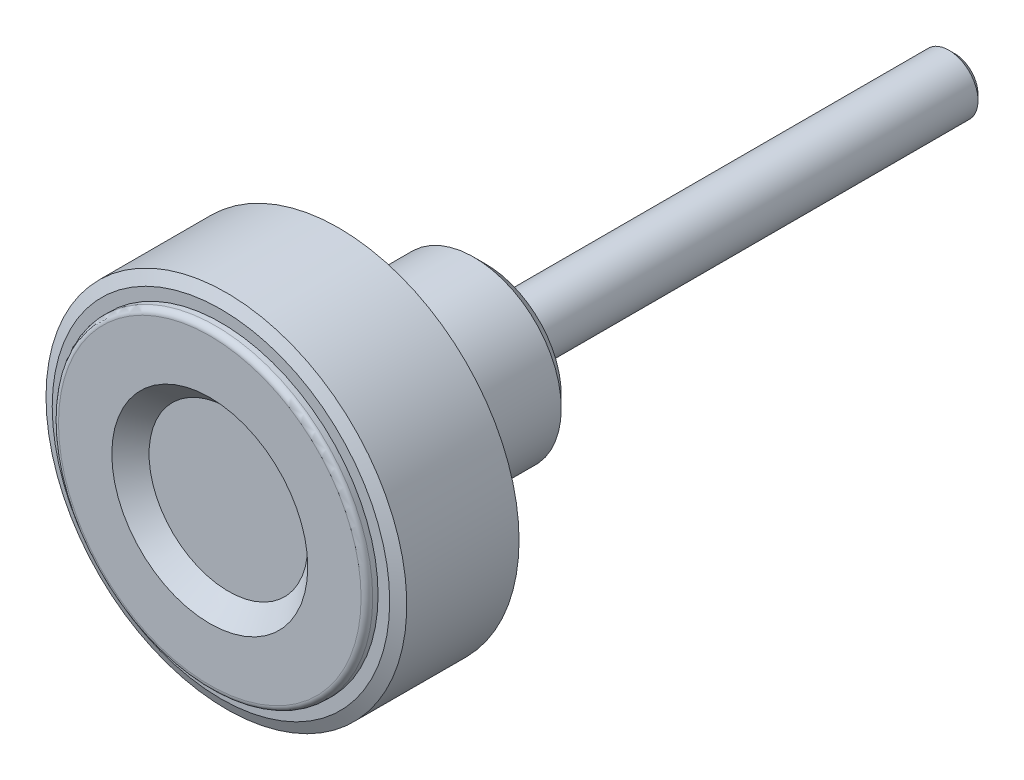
ISO-10303-21;
HEADER;
FILE_DESCRIPTION(('STEP AP214'),'2;1');
FILE_NAME('part.step','',(''),(''),'','','');
FILE_SCHEMA(('AUTOMOTIVE_DESIGN { 1 0 10303 214 1 1 1 1 }'));
ENDSEC;
DATA;
#1=APPLICATION_CONTEXT('core data for automotive mechanical design processes');
#2=APPLICATION_PROTOCOL_DEFINITION('international standard','automotive_design',2000,#1);
#3=PRODUCT_CONTEXT('',#1,'mechanical');
#4=PRODUCT('Part','Part','',(#3));
#5=PRODUCT_RELATED_PRODUCT_CATEGORY('part','',(#4));
#6=PRODUCT_DEFINITION_FORMATION('','',#4);
#7=PRODUCT_DEFINITION_CONTEXT('part definition',#1,'design');
#8=PRODUCT_DEFINITION('design','',#6,#7);
#9=PRODUCT_DEFINITION_SHAPE('','',#8);
#10=(LENGTH_UNIT() NAMED_UNIT(*) SI_UNIT(.MILLI.,.METRE.));
#11=(NAMED_UNIT(*) PLANE_ANGLE_UNIT() SI_UNIT($,.RADIAN.));
#12=(NAMED_UNIT(*) SI_UNIT($,.STERADIAN.) SOLID_ANGLE_UNIT());
#13=UNCERTAINTY_MEASURE_WITH_UNIT(LENGTH_MEASURE(1.E-05),#10,'distance_accuracy_value','');
#14=(GEOMETRIC_REPRESENTATION_CONTEXT(3) GLOBAL_UNCERTAINTY_ASSIGNED_CONTEXT((#13)) GLOBAL_UNIT_ASSIGNED_CONTEXT((#10,
#11,#12)) REPRESENTATION_CONTEXT('',''));
#15=CARTESIAN_POINT('',(0.,0.,0.));
#16=DIRECTION('',(0.,0.,1.));
#17=DIRECTION('',(1.,0.,0.));
#18=AXIS2_PLACEMENT_3D('',#15,#16,#17);
#19=CARTESIAN_POINT('',(0.,0.,0.));
#20=DIRECTION('',(0.,0.,-1.));
#21=DIRECTION('',(-1.,0.,0.));
#22=AXIS2_PLACEMENT_3D('',#19,#20,#21);
#23=CYLINDRICAL_SURFACE('',#22,15.5);
#24=CARTESIAN_POINT('',(0.,0.,22.573692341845));
#25=DIRECTION('',(0.,0.,-1.));
#26=DIRECTION('',(-1.,0.,0.));
#27=AXIS2_PLACEMENT_3D('',#24,#25,#26);
#28=CIRCLE('',#27,15.5);
#29=CARTESIAN_POINT('',(-15.5,0.,22.573692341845));
#30=VERTEX_POINT('',#29);
#31=EDGE_CURVE('E160',#30,#30,#28,.T.);
#32=ORIENTED_EDGE('',*,*,#31,.T.);
#33=EDGE_LOOP('',(#32));
#34=FACE_BOUND('',#33,.T.);
#35=CARTESIAN_POINT('',(0.,0.,12.926307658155));
#36=DIRECTION('',(0.,0.,1.));
#37=DIRECTION('',(0.,1.,0.));
#38=AXIS2_PLACEMENT_3D('',#35,#36,#37);
#39=CIRCLE('',#38,15.5);
#40=CARTESIAN_POINT('',(0.,15.5,12.926307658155));
#41=VERTEX_POINT('',#40);
#42=EDGE_CURVE('E156',#41,#41,#39,.F.);
#43=ORIENTED_EDGE('',*,*,#42,.F.);
#44=EDGE_LOOP('',(#43));
#45=FACE_BOUND('',#44,.T.);
#46=ADVANCED_FACE('F14',(#34,#45),#23,.T.);
#47=CARTESIAN_POINT('',(0.,0.,12.926307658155));
#48=DIRECTION('',(0.,0.,1.));
#49=DIRECTION('',(1.,0.,0.));
#50=AXIS2_PLACEMENT_3D('',#47,#48,#49);
#51=CONICAL_SURFACE('',#50,15.5,1.13446401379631);
#52=CARTESIAN_POINT('',(0.,0.,12.46));
#53=DIRECTION('',(0.,0.,1.));
#54=DIRECTION('',(1.,0.,0.));
#55=AXIS2_PLACEMENT_3D('',#52,#53,#54);
#56=CIRCLE('',#55,14.5);
#57=CARTESIAN_POINT('',(14.5,0.,12.46));
#58=VERTEX_POINT('',#57);
#59=EDGE_CURVE('E153',#58,#58,#56,.F.);
#60=ORIENTED_EDGE('',*,*,#59,.F.);
#61=EDGE_LOOP('',(#60));
#62=FACE_BOUND('',#61,.T.);
#63=ORIENTED_EDGE('',*,*,#42,.T.);
#64=EDGE_LOOP('',(#63));
#65=FACE_BOUND('',#64,.T.);
#66=ADVANCED_FACE('F397',(#62,#65),#51,.T.);
#67=CARTESIAN_POINT('',(0.,14.,12.46));
#68=DIRECTION('',(0.,0.,-1.));
#69=DIRECTION('',(-1.,0.,0.));
#70=AXIS2_PLACEMENT_3D('',#67,#68,#69);
#71=PLANE('',#70);
#72=ORIENTED_EDGE('',*,*,#59,.T.);
#73=EDGE_LOOP('',(#72));
#74=FACE_BOUND('',#73,.T.);
#75=CARTESIAN_POINT('',(0.,0.,12.46));
#76=DIRECTION('',(0.,0.,1.));
#77=DIRECTION('',(1.,0.,0.));
#78=AXIS2_PLACEMENT_3D('',#75,#76,#77);
#79=CIRCLE('',#78,13.5);
#80=CARTESIAN_POINT('',(13.5,0.,12.46));
#81=VERTEX_POINT('',#80);
#82=EDGE_CURVE('E149',#81,#81,#79,.F.);
#83=ORIENTED_EDGE('',*,*,#82,.F.);
#84=EDGE_LOOP('',(#83));
#85=FACE_BOUND('',#84,.T.);
#86=ADVANCED_FACE('F406',(#74,#85),#71,.T.);
#87=CARTESIAN_POINT('',(0.,0.,12.23));
#88=DIRECTION('',(0.,0.,1.));
#89=DIRECTION('',(1.,0.,0.));
#90=AXIS2_PLACEMENT_3D('',#87,#88,#89);
#91=CYLINDRICAL_SURFACE('',#90,13.5);
#92=ORIENTED_EDGE('',*,*,#82,.T.);
#93=EDGE_LOOP('',(#92));
#94=FACE_BOUND('',#93,.T.);
#95=CARTESIAN_POINT('',(0.,0.,12.));
#96=DIRECTION('',(0.,0.,-1.));
#97=DIRECTION('',(-1.,0.,0.));
#98=AXIS2_PLACEMENT_3D('',#95,#96,#97);
#99=CIRCLE('',#98,13.5);
#100=CARTESIAN_POINT('',(-13.5,0.,12.));
#101=VERTEX_POINT('',#100);
#102=EDGE_CURVE('E152',#101,#101,#99,.T.);
#103=ORIENTED_EDGE('',*,*,#102,.F.);
#104=EDGE_LOOP('',(#103));
#105=FACE_BOUND('',#104,.T.);
#106=ADVANCED_FACE('F581',(#94,#105),#91,.T.);
#107=CARTESIAN_POINT('',(0.,0.,12.));
#108=DIRECTION('',(0.,0.,-1.));
#109=DIRECTION('',(-1.,0.,0.));
#110=AXIS2_PLACEMENT_3D('',#107,#108,#109);
#111=TOROIDAL_SURFACE('',#110,13.,0.5);
#112=ORIENTED_EDGE('',*,*,#102,.T.);
#113=EDGE_LOOP('',(#112));
#114=FACE_BOUND('',#113,.T.);
#115=CARTESIAN_POINT('',(0.,0.,11.5));
#116=DIRECTION('',(0.,0.,1.));
#117=DIRECTION('',(1.,0.,0.));
#118=AXIS2_PLACEMENT_3D('',#115,#116,#117);
#119=CIRCLE('',#118,13.);
#120=CARTESIAN_POINT('',(0.,13.,11.5));
#121=VERTEX_POINT('',#120);
#122=CARTESIAN_POINT('',(13.,0.,11.5));
#123=VERTEX_POINT('',#122);
#124=EDGE_CURVE('E306',#121,#123,#119,.F.);
#125=ORIENTED_EDGE('',*,*,#124,.F.);
#126=CARTESIAN_POINT('',(0.,0.,11.5));
#127=DIRECTION('',(0.,0.,1.));
#128=DIRECTION('',(0.,1.,0.));
#129=AXIS2_PLACEMENT_3D('',#126,#127,#128);
#130=CIRCLE('',#129,13.);
#131=CARTESIAN_POINT('',(-13.,0.,11.5));
#132=VERTEX_POINT('',#131);
#133=EDGE_CURVE('E148',#132,#121,#130,.F.);
#134=ORIENTED_EDGE('',*,*,#133,.F.);
#135=CARTESIAN_POINT('',(0.,0.,11.5));
#136=DIRECTION('',(0.,0.,1.));
#137=DIRECTION('',(-1.,0.,0.));
#138=AXIS2_PLACEMENT_3D('',#135,#136,#137);
#139=CIRCLE('',#138,13.);
#140=EDGE_CURVE('E340',#123,#132,#139,.F.);
#141=ORIENTED_EDGE('',*,*,#140,.F.);
#142=EDGE_LOOP('',(#125,#134,#141));
#143=FACE_BOUND('',#142,.T.);
#144=ADVANCED_FACE('F439',(#114,#143),#111,.T.);
#145=CARTESIAN_POINT('',(0.,0.,-9.25475));
#146=DIRECTION('',(0.,0.,1.));
#147=DIRECTION('',(1.,0.,0.));
#148=AXIS2_PLACEMENT_3D('',#145,#146,#147);
#149=CYLINDRICAL_SURFACE('',#148,2.5);
#150=CARTESIAN_POINT('',(0.,0.,-39.51));
#151=DIRECTION('',(0.,0.,-1.));
#152=DIRECTION('',(-1.,0.,0.));
#153=AXIS2_PLACEMENT_3D('',#150,#151,#152);
#154=CIRCLE('',#153,2.5);
#155=CARTESIAN_POINT('',(-2.5,0.,-39.51));
#156=VERTEX_POINT('',#155);
#157=EDGE_CURVE('E9',#156,#156,#154,.F.);
#158=ORIENTED_EDGE('',*,*,#157,.T.);
#159=EDGE_LOOP('',(#158));
#160=FACE_BOUND('',#159,.T.);
#161=CARTESIAN_POINT('',(0.,0.,0.));
#162=DIRECTION('',(0.,0.,1.));
#163=DIRECTION('',(1.,0.,0.));
#164=AXIS2_PLACEMENT_3D('',#161,#162,#163);
#165=CIRCLE('',#164,2.5);
#166=CARTESIAN_POINT('',(2.5,0.,0.));
#167=VERTEX_POINT('',#166);
#168=EDGE_CURVE('E145',#167,#167,#165,.T.);
#169=ORIENTED_EDGE('',*,*,#168,.F.);
#170=EDGE_LOOP('',(#169));
#171=FACE_BOUND('',#170,.T.);
#172=ADVANCED_FACE('F323',(#160,#171),#149,.T.);
#173=CARTESIAN_POINT('',(0.,12.4615384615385,11.5));
#174=DIRECTION('',(0.,0.,-1.));
#175=DIRECTION('',(-1.,0.,0.));
#176=AXIS2_PLACEMENT_3D('',#173,#174,#175);
#177=PLANE('',#176);
#178=ORIENTED_EDGE('',*,*,#140,.T.);
#179=ORIENTED_EDGE('',*,*,#133,.T.);
#180=ORIENTED_EDGE('',*,*,#124,.T.);
#181=EDGE_LOOP('',(#178,#179,#180));
#182=FACE_BOUND('',#181,.T.);
#183=CARTESIAN_POINT('',(0.,0.,11.5));
#184=DIRECTION('',(0.,0.,1.));
#185=DIRECTION('',(1.,0.,0.));
#186=AXIS2_PLACEMENT_3D('',#183,#184,#185);
#187=CIRCLE('',#186,11.9230769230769);
#188=CARTESIAN_POINT('',(11.9230769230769,0.,11.5));
#189=VERTEX_POINT('',#188);
#190=EDGE_CURVE('E142',#189,#189,#187,.T.);
#191=ORIENTED_EDGE('',*,*,#190,.T.);
#192=EDGE_LOOP('',(#191));
#193=FACE_BOUND('',#192,.T.);
#194=ADVANCED_FACE('F312',(#182,#193),#177,.T.);
#195=CARTESIAN_POINT('',(0.,1.66666666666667,0.));
#196=DIRECTION('',(0.,0.,-1.));
#197=DIRECTION('',(-1.,0.,0.));
#198=AXIS2_PLACEMENT_3D('',#195,#196,#197);
#199=PLANE('',#198);
#200=CARTESIAN_POINT('',(0.,0.,0.));
#201=DIRECTION('',(0.,0.,1.));
#202=DIRECTION('',(1.,0.,0.));
#203=AXIS2_PLACEMENT_3D('',#200,#201,#202);
#204=CIRCLE('',#203,3.33333333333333);
#205=CARTESIAN_POINT('',(3.33333333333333,0.,0.));
#206=VERTEX_POINT('',#205);
#207=EDGE_CURVE('E139',#206,#206,#204,.T.);
#208=ORIENTED_EDGE('',*,*,#207,.F.);
#209=EDGE_LOOP('',(#208));
#210=FACE_BOUND('',#209,.T.);
#211=ORIENTED_EDGE('',*,*,#168,.T.);
#212=EDGE_LOOP('',(#211));
#213=FACE_BOUND('',#212,.T.);
#214=ADVANCED_FACE('F322',(#210,#213),#199,.T.);
#215=CARTESIAN_POINT('',(0.,0.,15.25));
#216=DIRECTION('',(0.,0.,1.));
#217=DIRECTION('',(1.,0.,0.));
#218=AXIS2_PLACEMENT_3D('',#215,#216,#217);
#219=CYLINDRICAL_SURFACE('',#218,11.9230769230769);
#220=CARTESIAN_POINT('',(0.,0.,19.));
#221=DIRECTION('',(0.,0.,-1.));
#222=DIRECTION('',(-1.,0.,0.));
#223=AXIS2_PLACEMENT_3D('',#220,#221,#222);
#224=CIRCLE('',#223,11.9230769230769);
#225=CARTESIAN_POINT('',(-11.9230769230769,0.,19.));
#226=VERTEX_POINT('',#225);
#227=EDGE_CURVE('E138',#226,#226,#224,.F.);
#228=ORIENTED_EDGE('',*,*,#227,.T.);
#229=EDGE_LOOP('',(#228));
#230=FACE_BOUND('',#229,.T.);
#231=ORIENTED_EDGE('',*,*,#190,.F.);
#232=EDGE_LOOP('',(#231));
#233=FACE_BOUND('',#232,.T.);
#234=ADVANCED_FACE('F443',(#230,#233),#219,.F.);
#235=CARTESIAN_POINT('',(0.,0.,0.15));
#236=DIRECTION('',(0.,0.,1.));
#237=DIRECTION('',(1.,0.,0.));
#238=AXIS2_PLACEMENT_3D('',#235,#236,#237);
#239=CYLINDRICAL_SURFACE('',#238,3.33333333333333);
#240=ORIENTED_EDGE('',*,*,#207,.T.);
#241=EDGE_LOOP('',(#240));
#242=FACE_BOUND('',#241,.T.);
#243=CARTESIAN_POINT('',(0.,0.,0.3));
#244=DIRECTION('',(0.,0.,1.));
#245=DIRECTION('',(1.,0.,0.));
#246=AXIS2_PLACEMENT_3D('',#243,#244,#245);
#247=CIRCLE('',#246,3.33333333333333);
#248=CARTESIAN_POINT('',(3.33333333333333,0.,0.3));
#249=VERTEX_POINT('',#248);
#250=EDGE_CURVE('E134',#249,#249,#247,.T.);
#251=ORIENTED_EDGE('',*,*,#250,.F.);
#252=EDGE_LOOP('',(#251));
#253=FACE_BOUND('',#252,.T.);
#254=ADVANCED_FACE('F282',(#242,#253),#239,.T.);
#255=CARTESIAN_POINT('',(0.,0.,19.));
#256=DIRECTION('',(0.,0.,-1.));
#257=DIRECTION('',(-1.,0.,0.));
#258=AXIS2_PLACEMENT_3D('',#255,#256,#257);
#259=TOROIDAL_SURFACE('',#258,10.9230769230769,1.);
#260=CARTESIAN_POINT('',(0.,0.,20.));
#261=DIRECTION('',(0.,0.,1.));
#262=DIRECTION('',(0.,1.,0.));
#263=AXIS2_PLACEMENT_3D('',#260,#261,#262);
#264=CIRCLE('',#263,10.9230769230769);
#265=CARTESIAN_POINT('',(-10.9230769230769,0.,20.));
#266=VERTEX_POINT('',#265);
#267=CARTESIAN_POINT('',(0.,10.9230769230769,20.));
#268=VERTEX_POINT('',#267);
#269=EDGE_CURVE('E133',#266,#268,#264,.F.);
#270=ORIENTED_EDGE('',*,*,#269,.F.);
#271=CARTESIAN_POINT('',(0.,0.,20.));
#272=DIRECTION('',(0.,0.,1.));
#273=DIRECTION('',(-1.,0.,0.));
#274=AXIS2_PLACEMENT_3D('',#271,#272,#273);
#275=CIRCLE('',#274,10.9230769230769);
#276=CARTESIAN_POINT('',(10.9230769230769,0.,20.));
#277=VERTEX_POINT('',#276);
#278=EDGE_CURVE('E656',#277,#266,#275,.F.);
#279=ORIENTED_EDGE('',*,*,#278,.F.);
#280=CARTESIAN_POINT('',(0.,0.,20.));
#281=DIRECTION('',(0.,0.,1.));
#282=DIRECTION('',(1.,0.,0.));
#283=AXIS2_PLACEMENT_3D('',#280,#281,#282);
#284=CIRCLE('',#283,10.9230769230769);
#285=EDGE_CURVE('E137',#268,#277,#284,.F.);
#286=ORIENTED_EDGE('',*,*,#285,.F.);
#287=EDGE_LOOP('',(#270,#279,#286));
#288=FACE_BOUND('',#287,.T.);
#289=ORIENTED_EDGE('',*,*,#227,.F.);
#290=EDGE_LOOP('',(#289));
#291=FACE_BOUND('',#290,.T.);
#292=ADVANCED_FACE('F278',(#288,#291),#259,.F.);
#293=CARTESIAN_POINT('',(0.,4.91666666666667,0.3));
#294=DIRECTION('',(0.,0.,-1.));
#295=DIRECTION('',(-1.,0.,0.));
#296=AXIS2_PLACEMENT_3D('',#293,#294,#295);
#297=PLANE('',#296);
#298=CARTESIAN_POINT('',(0.,0.,0.3));
#299=DIRECTION('',(0.,0.,1.));
#300=DIRECTION('',(1.,0.,0.));
#301=AXIS2_PLACEMENT_3D('',#298,#299,#300);
#302=CIRCLE('',#301,6.5);
#303=CARTESIAN_POINT('',(6.5,0.,0.3));
#304=VERTEX_POINT('',#303);
#305=EDGE_CURVE('E124',#304,#304,#302,.T.);
#306=ORIENTED_EDGE('',*,*,#305,.F.);
#307=EDGE_LOOP('',(#306));
#308=FACE_BOUND('',#307,.T.);
#309=ORIENTED_EDGE('',*,*,#250,.T.);
#310=EDGE_LOOP('',(#309));
#311=FACE_BOUND('',#310,.T.);
#312=ADVANCED_FACE('F215',(#308,#311),#297,.T.);
#313=CARTESIAN_POINT('',(0.,9.71153846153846,20.));
#314=DIRECTION('',(0.,0.,-1.));
#315=DIRECTION('',(-1.,0.,0.));
#316=AXIS2_PLACEMENT_3D('',#313,#314,#315);
#317=PLANE('',#316);
#318=ORIENTED_EDGE('',*,*,#278,.T.);
#319=ORIENTED_EDGE('',*,*,#269,.T.);
#320=ORIENTED_EDGE('',*,*,#285,.T.);
#321=EDGE_LOOP('',(#318,#319,#320));
#322=FACE_BOUND('',#321,.T.);
#323=CARTESIAN_POINT('',(0.,0.,20.));
#324=DIRECTION('',(0.,0.,-1.));
#325=DIRECTION('',(-1.,0.,0.));
#326=AXIS2_PLACEMENT_3D('',#323,#324,#325);
#327=CIRCLE('',#326,8.5);
#328=CARTESIAN_POINT('',(0.,8.5,20.));
#329=VERTEX_POINT('',#328);
#330=CARTESIAN_POINT('',(-8.5,0.,20.));
#331=VERTEX_POINT('',#330);
#332=EDGE_CURVE('E31',#329,#331,#327,.F.);
#333=ORIENTED_EDGE('',*,*,#332,.T.);
#334=CARTESIAN_POINT('',(0.,0.,20.));
#335=DIRECTION('',(0.,0.,-1.));
#336=DIRECTION('',(1.,0.,0.));
#337=AXIS2_PLACEMENT_3D('',#334,#335,#336);
#338=CIRCLE('',#337,8.5);
#339=CARTESIAN_POINT('',(8.5,0.,20.));
#340=VERTEX_POINT('',#339);
#341=EDGE_CURVE('E132',#331,#340,#338,.F.);
#342=ORIENTED_EDGE('',*,*,#341,.T.);
#343=CARTESIAN_POINT('',(0.,0.,20.));
#344=DIRECTION('',(0.,0.,-1.));
#345=DIRECTION('',(0.,1.,0.));
#346=AXIS2_PLACEMENT_3D('',#343,#344,#345);
#347=CIRCLE('',#346,8.5);
#348=EDGE_CURVE('E202',#340,#329,#347,.F.);
#349=ORIENTED_EDGE('',*,*,#348,.T.);
#350=EDGE_LOOP('',(#333,#342,#349));
#351=FACE_BOUND('',#350,.T.);
#352=ADVANCED_FACE('F206',(#322,#351),#317,.T.);
#353=CARTESIAN_POINT('',(0.,0.,1.3));
#354=DIRECTION('',(0.,0.,1.));
#355=DIRECTION('',(1.,0.,0.));
#356=AXIS2_PLACEMENT_3D('',#353,#354,#355);
#357=CONICAL_SURFACE('',#356,7.5,0.785398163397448);
#358=ORIENTED_EDGE('',*,*,#305,.T.);
#359=EDGE_LOOP('',(#358));
#360=FACE_BOUND('',#359,.T.);
#361=CARTESIAN_POINT('',(0.,0.,1.3));
#362=DIRECTION('',(0.,0.,1.));
#363=DIRECTION('',(1.,0.,0.));
#364=AXIS2_PLACEMENT_3D('',#361,#362,#363);
#365=CIRCLE('',#364,7.5);
#366=CARTESIAN_POINT('',(7.5,0.,1.3));
#367=VERTEX_POINT('',#366);
#368=EDGE_CURVE('E267',#367,#367,#365,.T.);
#369=ORIENTED_EDGE('',*,*,#368,.F.);
#370=EDGE_LOOP('',(#369));
#371=FACE_BOUND('',#370,.T.);
#372=ADVANCED_FACE('F190',(#360,#371),#357,.T.);
#373=CARTESIAN_POINT('',(0.,0.,19.));
#374=DIRECTION('',(0.,0.,-1.));
#375=DIRECTION('',(-1.,0.,0.));
#376=AXIS2_PLACEMENT_3D('',#373,#374,#375);
#377=TOROIDAL_SURFACE('',#376,8.5,1.);
#378=CARTESIAN_POINT('',(0.,0.,19.));
#379=DIRECTION('',(0.,0.,1.));
#380=DIRECTION('',(1.,0.,0.));
#381=AXIS2_PLACEMENT_3D('',#378,#379,#380);
#382=CIRCLE('',#381,7.5);
#383=CARTESIAN_POINT('',(7.5,0.,19.));
#384=VERTEX_POINT('',#383);
#385=EDGE_CURVE('E200',#384,#384,#382,.F.);
#386=ORIENTED_EDGE('',*,*,#385,.F.);
#387=EDGE_LOOP('',(#386));
#388=FACE_BOUND('',#387,.T.);
#389=ORIENTED_EDGE('',*,*,#341,.F.);
#390=ORIENTED_EDGE('',*,*,#332,.F.);
#391=ORIENTED_EDGE('',*,*,#348,.F.);
#392=EDGE_LOOP('',(#389,#390,#391));
#393=FACE_BOUND('',#392,.T.);
#394=ADVANCED_FACE('F178',(#388,#393),#377,.F.);
#395=CARTESIAN_POINT('',(0.,0.,10.15));
#396=DIRECTION('',(0.,0.,1.));
#397=DIRECTION('',(1.,0.,0.));
#398=AXIS2_PLACEMENT_3D('',#395,#396,#397);
#399=CYLINDRICAL_SURFACE('',#398,7.5);
#400=ORIENTED_EDGE('',*,*,#368,.T.);
#401=EDGE_LOOP('',(#400));
#402=FACE_BOUND('',#401,.T.);
#403=ORIENTED_EDGE('',*,*,#385,.T.);
#404=EDGE_LOOP('',(#403));
#405=FACE_BOUND('',#404,.T.);
#406=ADVANCED_FACE('F189',(#402,#405),#399,.T.);
#407=CARTESIAN_POINT('',(0.,3.40909090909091,22.4));
#408=DIRECTION('',(0.,0.,1.));
#409=DIRECTION('',(1.,0.,0.));
#410=AXIS2_PLACEMENT_3D('',#407,#408,#409);
#411=PLANE('',#410);
#412=CARTESIAN_POINT('',(0.,0.,22.4));
#413=DIRECTION('',(0.,0.,1.));
#414=DIRECTION('',(1.,0.,0.));
#415=AXIS2_PLACEMENT_3D('',#412,#413,#414);
#416=CIRCLE('',#415,6.81818181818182);
#417=CARTESIAN_POINT('',(6.81818181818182,0.,22.4));
#418=VERTEX_POINT('',#417);
#419=EDGE_CURVE('E167',#418,#418,#416,.T.);
#420=ORIENTED_EDGE('',*,*,#419,.T.);
#421=EDGE_LOOP('',(#420));
#422=FACE_BOUND('',#421,.T.);
#423=ADVANCED_FACE('F366',(#422),#411,.T.);
#424=CARTESIAN_POINT('',(0.,0.,24.));
#425=DIRECTION('',(0.,0.,1.));
#426=DIRECTION('',(1.,0.,0.));
#427=AXIS2_PLACEMENT_3D('',#424,#425,#426);
#428=CONICAL_SURFACE('',#427,8.41818181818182,0.785398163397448);
#429=CARTESIAN_POINT('',(0.,0.,24.));
#430=DIRECTION('',(0.,0.,1.));
#431=DIRECTION('',(1.,0.,0.));
#432=AXIS2_PLACEMENT_3D('',#429,#430,#431);
#433=CIRCLE('',#432,8.41818181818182);
#434=CARTESIAN_POINT('',(8.41818181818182,0.,24.));
#435=VERTEX_POINT('',#434);
#436=EDGE_CURVE('E75',#435,#435,#433,.F.);
#437=ORIENTED_EDGE('',*,*,#436,.F.);
#438=EDGE_LOOP('',(#437));
#439=FACE_BOUND('',#438,.T.);
#440=ORIENTED_EDGE('',*,*,#419,.F.);
#441=EDGE_LOOP('',(#440));
#442=FACE_BOUND('',#441,.T.);
#443=ADVANCED_FACE('F98',(#439,#442),#428,.F.);
#444=CARTESIAN_POINT('',(0.,10.7090909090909,24.));
#445=DIRECTION('',(0.,0.,1.));
#446=DIRECTION('',(1.,0.,0.));
#447=AXIS2_PLACEMENT_3D('',#444,#445,#446);
#448=PLANE('',#447);
#449=ORIENTED_EDGE('',*,*,#436,.T.);
#450=EDGE_LOOP('',(#449));
#451=FACE_BOUND('',#450,.T.);
#452=CARTESIAN_POINT('',(0.,0.,24.));
#453=DIRECTION('',(0.,0.,-1.));
#454=DIRECTION('',(-1.,0.,0.));
#455=AXIS2_PLACEMENT_3D('',#452,#453,#454);
#456=CIRCLE('',#455,13.);
#457=CARTESIAN_POINT('',(-13.,0.,24.));
#458=VERTEX_POINT('',#457);
#459=CARTESIAN_POINT('',(0.,13.,24.));
#460=VERTEX_POINT('',#459);
#461=EDGE_CURVE('E69',#458,#460,#456,.T.);
#462=ORIENTED_EDGE('',*,*,#461,.F.);
#463=CARTESIAN_POINT('',(0.,0.,24.));
#464=DIRECTION('',(0.,0.,-1.));
#465=DIRECTION('',(1.,0.,0.));
#466=AXIS2_PLACEMENT_3D('',#463,#464,#465);
#467=CIRCLE('',#466,13.);
#468=CARTESIAN_POINT('',(13.,0.,24.));
#469=VERTEX_POINT('',#468);
#470=EDGE_CURVE('E64',#469,#458,#467,.T.);
#471=ORIENTED_EDGE('',*,*,#470,.F.);
#472=CARTESIAN_POINT('',(0.,0.,24.));
#473=DIRECTION('',(0.,0.,-1.));
#474=DIRECTION('',(0.,1.,0.));
#475=AXIS2_PLACEMENT_3D('',#472,#473,#474);
#476=CIRCLE('',#475,13.);
#477=EDGE_CURVE('E71',#460,#469,#476,.T.);
#478=ORIENTED_EDGE('',*,*,#477,.F.);
#479=EDGE_LOOP('',(#462,#471,#478));
#480=FACE_BOUND('',#479,.T.);
#481=ADVANCED_FACE('F79',(#451,#480),#448,.T.);
#482=CARTESIAN_POINT('',(0.,0.,23.5));
#483=DIRECTION('',(0.,0.,-1.));
#484=DIRECTION('',(-1.,0.,0.));
#485=AXIS2_PLACEMENT_3D('',#482,#483,#484);
#486=TOROIDAL_SURFACE('',#485,13.,0.5);
#487=ORIENTED_EDGE('',*,*,#470,.T.);
#488=ORIENTED_EDGE('',*,*,#461,.T.);
#489=ORIENTED_EDGE('',*,*,#477,.T.);
#490=EDGE_LOOP('',(#487,#488,#489));
#491=FACE_BOUND('',#490,.T.);
#492=CARTESIAN_POINT('',(0.,0.,23.5));
#493=DIRECTION('',(0.,0.,1.));
#494=DIRECTION('',(1.,0.,0.));
#495=AXIS2_PLACEMENT_3D('',#492,#493,#494);
#496=CIRCLE('',#495,13.5);
#497=CARTESIAN_POINT('',(13.5,0.,23.5));
#498=VERTEX_POINT('',#497);
#499=EDGE_CURVE('E164',#498,#498,#496,.F.);
#500=ORIENTED_EDGE('',*,*,#499,.F.);
#501=EDGE_LOOP('',(#500));
#502=FACE_BOUND('',#501,.T.);
#503=ADVANCED_FACE('F67',(#491,#502),#486,.T.);
#504=CARTESIAN_POINT('',(0.,0.,23.27));
#505=DIRECTION('',(0.,0.,1.));
#506=DIRECTION('',(1.,0.,0.));
#507=AXIS2_PLACEMENT_3D('',#504,#505,#506);
#508=CYLINDRICAL_SURFACE('',#507,13.5);
#509=CARTESIAN_POINT('',(0.,0.,23.04));
#510=DIRECTION('',(0.,0.,1.));
#511=DIRECTION('',(1.,0.,0.));
#512=AXIS2_PLACEMENT_3D('',#509,#510,#511);
#513=CIRCLE('',#512,13.5);
#514=CARTESIAN_POINT('',(13.5,0.,23.04));
#515=VERTEX_POINT('',#514);
#516=EDGE_CURVE('E161',#515,#515,#513,.F.);
#517=ORIENTED_EDGE('',*,*,#516,.F.);
#518=EDGE_LOOP('',(#517));
#519=FACE_BOUND('',#518,.T.);
#520=ORIENTED_EDGE('',*,*,#499,.T.);
#521=EDGE_LOOP('',(#520));
#522=FACE_BOUND('',#521,.T.);
#523=ADVANCED_FACE('F356',(#519,#522),#508,.T.);
#524=CARTESIAN_POINT('',(0.,0.,22.573692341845));
#525=DIRECTION('',(0.,0.,-1.));
#526=DIRECTION('',(-1.,0.,0.));
#527=AXIS2_PLACEMENT_3D('',#524,#525,#526);
#528=CONICAL_SURFACE('',#527,15.5,1.13446401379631);
#529=ORIENTED_EDGE('',*,*,#31,.F.);
#530=EDGE_LOOP('',(#529));
#531=FACE_BOUND('',#530,.T.);
#532=CARTESIAN_POINT('',(0.,0.,23.04));
#533=DIRECTION('',(0.,0.,-1.));
#534=DIRECTION('',(-1.,0.,0.));
#535=AXIS2_PLACEMENT_3D('',#532,#533,#534);
#536=CIRCLE('',#535,14.5);
#537=CARTESIAN_POINT('',(-14.5,0.,23.04));
#538=VERTEX_POINT('',#537);
#539=EDGE_CURVE('E157',#538,#538,#536,.T.);
#540=ORIENTED_EDGE('',*,*,#539,.T.);
#541=EDGE_LOOP('',(#540));
#542=FACE_BOUND('',#541,.T.);
#543=ADVANCED_FACE('F363',(#531,#542),#528,.T.);
#544=CARTESIAN_POINT('',(0.,14.,23.04));
#545=DIRECTION('',(0.,0.,1.));
#546=DIRECTION('',(1.,0.,0.));
#547=AXIS2_PLACEMENT_3D('',#544,#545,#546);
#548=PLANE('',#547);
#549=ORIENTED_EDGE('',*,*,#516,.T.);
#550=EDGE_LOOP('',(#549));
#551=FACE_BOUND('',#550,.T.);
#552=ORIENTED_EDGE('',*,*,#539,.F.);
#553=EDGE_LOOP('',(#552));
#554=FACE_BOUND('',#553,.T.);
#555=ADVANCED_FACE('F413',(#551,#554),#548,.T.);
#556=CARTESIAN_POINT('',(0.,0.,-40.));
#557=DIRECTION('',(0.,0.,-1.));
#558=DIRECTION('',(-1.,0.,0.));
#559=AXIS2_PLACEMENT_3D('',#556,#557,#558);
#560=PLANE('',#559);
#561=CARTESIAN_POINT('',(0.,0.,-40.));
#562=DIRECTION('',(0.,0.,-1.));
#563=DIRECTION('',(-1.,0.,0.));
#564=AXIS2_PLACEMENT_3D('',#561,#562,#563);
#565=CIRCLE('',#564,2.01);
#566=CARTESIAN_POINT('',(-2.01,0.,-40.));
#567=VERTEX_POINT('',#566);
#568=EDGE_CURVE('E23',#567,#567,#565,.T.);
#569=ORIENTED_EDGE('',*,*,#568,.T.);
#570=EDGE_LOOP('',(#569));
#571=FACE_BOUND('',#570,.T.);
#572=ADVANCED_FACE('F416',(#571),#560,.T.);
#573=CARTESIAN_POINT('',(0.,0.,-40.));
#574=DIRECTION('',(0.,0.,1.));
#575=DIRECTION('',(1.,0.,0.));
#576=AXIS2_PLACEMENT_3D('',#573,#574,#575);
#577=CONICAL_SURFACE('',#576,2.01,0.785398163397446);
#578=ORIENTED_EDGE('',*,*,#157,.F.);
#579=EDGE_LOOP('',(#578));
#580=FACE_BOUND('',#579,.T.);
#581=ORIENTED_EDGE('',*,*,#568,.F.);
#582=EDGE_LOOP('',(#581));
#583=FACE_BOUND('',#582,.T.);
#584=ADVANCED_FACE('F16',(#580,#583),#577,.T.);
#585=CLOSED_SHELL('',(#46,#66,#86,#106,#144,#172,#194,#214,#234,#254,#292,#312,#352,#372,#394,
#406,#423,#443,#481,#503,#523,#543,#555,#572,#584));
#586=MANIFOLD_SOLID_BREP('B1',#585);
#587=ADVANCED_BREP_SHAPE_REPRESENTATION('',(#18,#586),#14);
#588=SHAPE_DEFINITION_REPRESENTATION(#9,#587);
ENDSEC;
END-ISO-10303-21;
